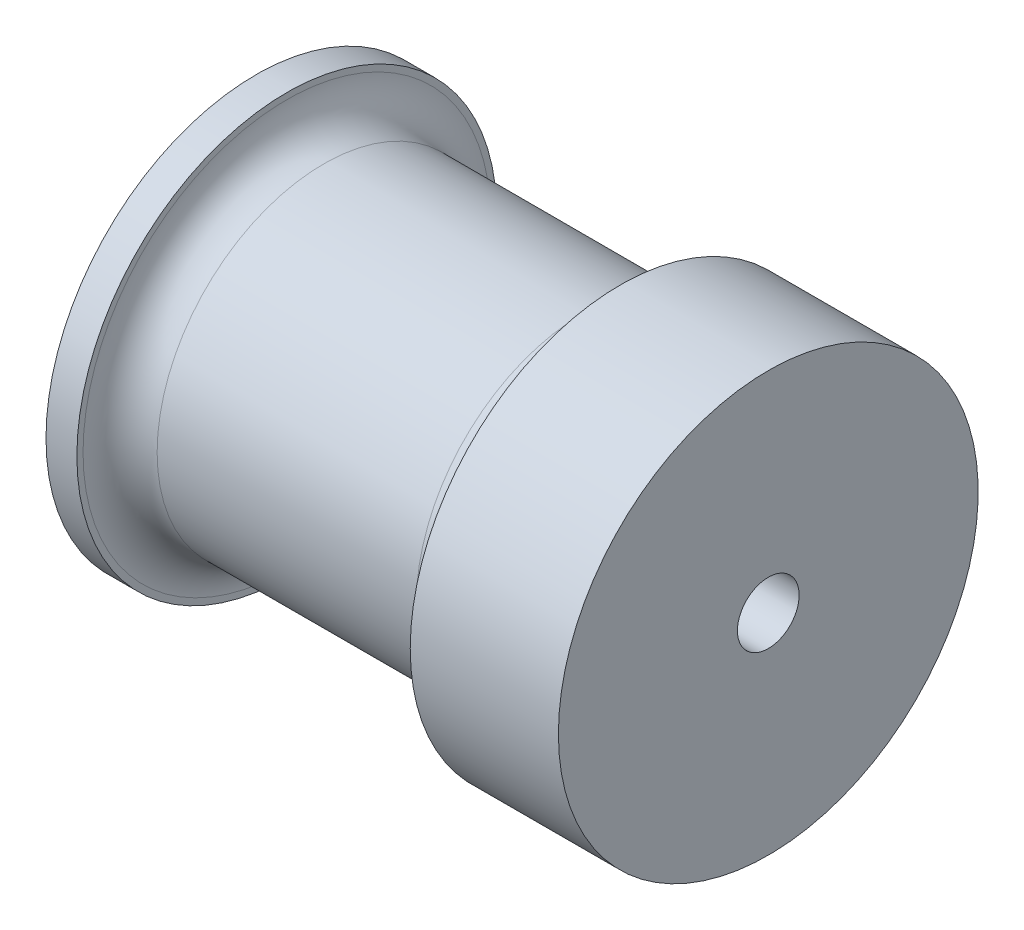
ISO-10303-21;
HEADER;
FILE_DESCRIPTION(('STEP AP214'),'2;1');
FILE_NAME('part.step','',(''),(''),'','','');
FILE_SCHEMA(('AUTOMOTIVE_DESIGN { 1 0 10303 214 1 1 1 1 }'));
ENDSEC;
DATA;
#1=APPLICATION_CONTEXT('core data for automotive mechanical design processes');
#2=APPLICATION_PROTOCOL_DEFINITION('international standard','automotive_design',2000,#1);
#3=PRODUCT_CONTEXT('',#1,'mechanical');
#4=PRODUCT('Part','Part','',(#3));
#5=PRODUCT_RELATED_PRODUCT_CATEGORY('part','',(#4));
#6=PRODUCT_DEFINITION_FORMATION('','',#4);
#7=PRODUCT_DEFINITION_CONTEXT('part definition',#1,'design');
#8=PRODUCT_DEFINITION('design','',#6,#7);
#9=PRODUCT_DEFINITION_SHAPE('','',#8);
#10=(LENGTH_UNIT() NAMED_UNIT(*) SI_UNIT(.MILLI.,.METRE.));
#11=(NAMED_UNIT(*) PLANE_ANGLE_UNIT() SI_UNIT($,.RADIAN.));
#12=(NAMED_UNIT(*) SI_UNIT($,.STERADIAN.) SOLID_ANGLE_UNIT());
#13=UNCERTAINTY_MEASURE_WITH_UNIT(LENGTH_MEASURE(1.E-05),#10,'distance_accuracy_value','');
#14=(GEOMETRIC_REPRESENTATION_CONTEXT(3) GLOBAL_UNCERTAINTY_ASSIGNED_CONTEXT((#13)) GLOBAL_UNIT_ASSIGNED_CONTEXT((#10,
#11,#12)) REPRESENTATION_CONTEXT('',''));
#15=CARTESIAN_POINT('',(0.,0.,0.));
#16=DIRECTION('',(0.,0.,1.));
#17=DIRECTION('',(1.,0.,0.));
#18=AXIS2_PLACEMENT_3D('',#15,#16,#17);
#19=CARTESIAN_POINT('',(-18.073585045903,0.,0.));
#20=DIRECTION('',(-1.,0.,0.));
#21=DIRECTION('',(0.,0.,1.));
#22=AXIS2_PLACEMENT_3D('',#19,#20,#21);
#23=CYLINDRICAL_SURFACE('',#22,9.525);
#24=CARTESIAN_POINT('',(-26.3525,-9.47318262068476,0.992187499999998));
#25=CARTESIAN_POINT('',(-26.2969308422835,-9.47318329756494,0.992185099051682));
#26=CARTESIAN_POINT('',(-26.2413252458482,-9.47367684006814,0.987503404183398));
#27=CARTESIAN_POINT('',(-26.1316566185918,-9.47559733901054,0.968898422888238));
#28=CARTESIAN_POINT('',(-26.0775953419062,-9.47702531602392,0.954965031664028));
#29=CARTESIAN_POINT('',(-25.97261934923,-9.4806512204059,0.918267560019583));
#30=CARTESIAN_POINT('',(-25.9217027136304,-9.48284867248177,0.895508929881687));
#31=CARTESIAN_POINT('',(-25.8244227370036,-9.48776534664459,0.84181767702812));
#32=CARTESIAN_POINT('',(-25.7780585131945,-9.49048446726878,0.810886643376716));
#33=CARTESIAN_POINT('',(-25.691006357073,-9.49615008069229,0.7415979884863));
#34=CARTESIAN_POINT('',(-25.6503388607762,-9.49909733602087,0.703214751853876));
#35=CARTESIAN_POINT('',(-25.5760106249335,-9.50488022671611,0.620166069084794));
#36=CARTESIAN_POINT('',(-25.5423502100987,-9.50771585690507,0.575500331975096));
#37=CARTESIAN_POINT('',(-25.4829205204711,-9.51296358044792,0.481028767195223));
#38=CARTESIAN_POINT('',(-25.4571694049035,-9.51537469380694,0.431211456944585));
#39=CARTESIAN_POINT('',(-25.4144054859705,-9.51949340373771,0.327930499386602));
#40=CARTESIAN_POINT('',(-25.3973924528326,-9.52120101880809,0.27446694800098));
#41=CARTESIAN_POINT('',(-25.3726477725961,-9.52371497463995,0.165618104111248));
#42=CARTESIAN_POINT('',(-25.3648824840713,-9.52452458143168,0.110240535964));
#43=CARTESIAN_POINT('',(-25.3587496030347,-9.5251624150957,-0.0010373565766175));
#44=CARTESIAN_POINT('',(-25.3603817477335,-9.52499066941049,-0.0569376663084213));
#45=CARTESIAN_POINT('',(-25.3729701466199,-9.52368781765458,-0.16744578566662));
#46=CARTESIAN_POINT('',(-25.3838902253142,-9.52256043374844,-0.22205776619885));
#47=CARTESIAN_POINT('',(-25.414688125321,-9.51947725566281,-0.328669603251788));
#48=CARTESIAN_POINT('',(-25.4345660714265,-9.51752144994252,-0.380669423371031));
#49=CARTESIAN_POINT('',(-25.4827549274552,-9.51299488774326,-0.480694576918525));
#50=CARTESIAN_POINT('',(-25.5110817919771,-9.51042296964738,-0.528712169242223));
#51=CARTESIAN_POINT('',(-25.5753528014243,-9.50495264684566,-0.619325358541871));
#52=CARTESIAN_POINT('',(-25.6112971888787,-9.50205423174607,-0.661920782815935));
#53=CARTESIAN_POINT('',(-25.6899862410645,-9.49623979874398,-0.740692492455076));
#54=CARTESIAN_POINT('',(-25.7327623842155,-9.49332376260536,-0.776837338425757));
#55=CARTESIAN_POINT('',(-25.8237917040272,-9.4878164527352,-0.841438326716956));
#56=CARTESIAN_POINT('',(-25.8720448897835,-9.48522517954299,-0.869894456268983));
#57=CARTESIAN_POINT('',(-25.9726833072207,-9.48066060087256,-0.918310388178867));
#58=CARTESIAN_POINT('',(-26.0250695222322,-9.4786874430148,-0.938268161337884));
#59=CARTESIAN_POINT('',(-26.1324746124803,-9.47558552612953,-0.969095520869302));
#60=CARTESIAN_POINT('',(-26.1874934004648,-9.47445673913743,-0.979965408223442));
#61=CARTESIAN_POINT('',(-26.2983255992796,-9.47317625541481,-0.992267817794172));
#62=CARTESIAN_POINT('',(-26.3541340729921,-9.47302000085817,-0.993744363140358));
#63=CARTESIAN_POINT('',(-26.4652038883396,-9.4736902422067,-0.987333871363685));
#64=CARTESIAN_POINT('',(-26.5204652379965,-9.47451672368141,-0.979446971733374));
#65=CARTESIAN_POINT('',(-26.6287432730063,-9.47705516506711,-0.954570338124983));
#66=CARTESIAN_POINT('',(-26.6817648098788,-9.47876509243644,-0.937601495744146));
#67=CARTESIAN_POINT('',(-26.7842090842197,-9.48287611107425,-0.895064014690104));
#68=CARTESIAN_POINT('',(-26.8336317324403,-9.48527721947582,-0.86949516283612));
#69=CARTESIAN_POINT('',(-26.9276757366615,-9.49051107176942,-0.810373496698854));
#70=CARTESIAN_POINT('',(-26.9722786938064,-9.49334537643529,-0.776791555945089));
#71=CARTESIAN_POINT('',(-27.0552304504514,-9.49912119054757,-0.702638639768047));
#72=CARTESIAN_POINT('',(-27.0935790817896,-9.50206270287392,-0.662067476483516));
#73=CARTESIAN_POINT('',(-27.1630858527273,-9.50773529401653,-0.574896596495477));
#74=CARTESIAN_POINT('',(-27.1942152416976,-9.510465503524,-0.528273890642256));
#75=CARTESIAN_POINT('',(-27.2482018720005,-9.51539516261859,-0.430436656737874));
#76=CARTESIAN_POINT('',(-27.271059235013,-9.51759462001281,-0.379222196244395));
#77=CARTESIAN_POINT('',(-27.3078044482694,-9.52121104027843,-0.273754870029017));
#78=CARTESIAN_POINT('',(-27.3217095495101,-9.52262950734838,-0.219508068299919));
#79=CARTESIAN_POINT('',(-27.3402117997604,-9.52453030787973,-0.109434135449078));
#80=CARTESIAN_POINT('',(-27.344809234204,-9.52501267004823,-0.0536070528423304));
#81=CARTESIAN_POINT('',(-27.3445614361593,-9.52498687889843,0.0577605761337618));
#82=CARTESIAN_POINT('',(-27.3397607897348,-9.52448340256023,0.113301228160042));
#83=CARTESIAN_POINT('',(-27.3209467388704,-9.52255174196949,0.222782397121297));
#84=CARTESIAN_POINT('',(-27.3069333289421,-9.52112355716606,0.276722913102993));
#85=CARTESIAN_POINT('',(-27.2701041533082,-9.51750244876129,0.381471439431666));
#86=CARTESIAN_POINT('',(-27.2472898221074,-9.51530964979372,0.432279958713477));
#87=CARTESIAN_POINT('',(-27.1935111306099,-9.5104034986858,0.529353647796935));
#88=CARTESIAN_POINT('',(-27.1625467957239,-9.50769014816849,0.575618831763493));
#89=CARTESIAN_POINT('',(-27.0931801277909,-9.50203130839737,0.662520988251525));
#90=CARTESIAN_POINT('',(-27.0547445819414,-9.49908481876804,0.703131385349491));
#91=CARTESIAN_POINT('',(-26.9715928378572,-9.49330019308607,0.777345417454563));
#92=CARTESIAN_POINT('',(-26.9268751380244,-9.49046208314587,0.810947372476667));
#93=CARTESIAN_POINT('',(-26.8322932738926,-9.48520725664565,0.870264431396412));
#94=CARTESIAN_POINT('',(-26.7824153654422,-9.48279171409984,0.895957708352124));
#95=CARTESIAN_POINT('',(-26.6790592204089,-9.47866945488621,0.938569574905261));
#96=CARTESIAN_POINT('',(-26.6255850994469,-9.47696194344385,0.95549800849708));
#97=CARTESIAN_POINT('',(-26.5352599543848,-9.47487728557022,0.975903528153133));
#98=CARTESIAN_POINT('',(-26.4989853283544,-9.47424481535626,0.982001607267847));
#99=CARTESIAN_POINT('',(-26.425979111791,-9.47339726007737,0.990144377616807));
#100=CARTESIAN_POINT('',(-26.3892475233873,-9.47318217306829,0.992189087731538));
#101=CARTESIAN_POINT('',(-26.3525,-9.47318262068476,0.992187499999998));
#102=B_SPLINE_CURVE_WITH_KNOTS('',3,(#24,#25,#26,#27,#28,#29,#30,#31,#32,#33,#34,#35,#36,#37,
#38,#39,#40,#41,#42,#43,#44,#45,#46,#47,#48,#49,#50,#51,#52,#53,#54,#55,#56,#57,#58,#59,#60,#61,
#62,#63,#64,#65,#66,#67,#68,#69,#70,#71,#72,#73,#74,#75,#76,#77,#78,#79,#80,#81,#82,#83,#84,#85,
#86,#87,#88,#89,#90,#91,#92,#93,#94,#95,#96,#97,#98,#99,#100,#101),.UNSPECIFIED.,.T.,.F.,(4,2,2,
2,2,2,2,2,2,2,2,2,2,2,2,2,2,2,2,2,2,2,2,2,2,2,2,2,2,2,2,2,2,2,2,2,2,2,4),(0.,0.166573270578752,
0.333328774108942,0.499981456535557,0.66660175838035,0.833805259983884,1.00101650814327,
1.16860884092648,1.3361967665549,1.50317316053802,1.67014488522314,1.8364692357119,
2.00279590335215,2.16943866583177,2.33608673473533,2.5035260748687,2.67096569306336,
2.83844526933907,3.00591929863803,3.17260785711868,3.33929396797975,3.505598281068,
3.67190671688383,3.83882912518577,4.00575602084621,4.17333670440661,4.34091492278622,
4.508169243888,4.67541843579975,4.84187609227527,5.00833384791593,5.17476448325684,
5.34119459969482,5.50838222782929,5.67560988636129,5.84329501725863,6.01079140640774,
6.12094574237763,6.23109956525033),.UNSPECIFIED.);
#103=CARTESIAN_POINT('',(-26.3525,-9.47318262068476,0.992187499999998));
#104=VERTEX_POINT('',#103);
#105=EDGE_CURVE('E93',#104,#104,#102,.T.);
#106=ORIENTED_EDGE('',*,*,#105,.T.);
#107=EDGE_LOOP('',(#106));
#108=FACE_BOUND('',#107,.T.);
#109=CARTESIAN_POINT('',(-26.3525,9.47318262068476,0.992187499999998));
#110=CARTESIAN_POINT('',(-26.4080691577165,9.47318329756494,0.992185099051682));
#111=CARTESIAN_POINT('',(-26.4636747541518,9.47367684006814,0.987503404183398));
#112=CARTESIAN_POINT('',(-26.5733433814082,9.47559733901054,0.968898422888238));
#113=CARTESIAN_POINT('',(-26.6274046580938,9.47702531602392,0.954965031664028));
#114=CARTESIAN_POINT('',(-26.73238065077,9.4806512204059,0.918267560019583));
#115=CARTESIAN_POINT('',(-26.7832972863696,9.48284867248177,0.895508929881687));
#116=CARTESIAN_POINT('',(-26.8805772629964,9.48776534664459,0.84181767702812));
#117=CARTESIAN_POINT('',(-26.9269414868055,9.49048446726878,0.810886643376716));
#118=CARTESIAN_POINT('',(-27.013993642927,9.49615008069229,0.7415979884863));
#119=CARTESIAN_POINT('',(-27.0546611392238,9.49909733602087,0.703214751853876));
#120=CARTESIAN_POINT('',(-27.1289893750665,9.50488022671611,0.620166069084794));
#121=CARTESIAN_POINT('',(-27.1626497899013,9.50771585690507,0.575500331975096));
#122=CARTESIAN_POINT('',(-27.2220794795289,9.51296358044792,0.481028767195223));
#123=CARTESIAN_POINT('',(-27.2478305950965,9.51537469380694,0.431211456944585));
#124=CARTESIAN_POINT('',(-27.2905945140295,9.51949340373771,0.327930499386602));
#125=CARTESIAN_POINT('',(-27.3076075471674,9.52120101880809,0.27446694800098));
#126=CARTESIAN_POINT('',(-27.3323522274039,9.52371497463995,0.165618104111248));
#127=CARTESIAN_POINT('',(-27.3401175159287,9.52452458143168,0.110240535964));
#128=CARTESIAN_POINT('',(-27.3462503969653,9.5251624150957,-0.0010373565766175));
#129=CARTESIAN_POINT('',(-27.3446182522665,9.52499066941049,-0.0569376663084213));
#130=CARTESIAN_POINT('',(-27.3320298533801,9.52368781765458,-0.16744578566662));
#131=CARTESIAN_POINT('',(-27.3211097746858,9.52256043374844,-0.22205776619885));
#132=CARTESIAN_POINT('',(-27.290311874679,9.51947725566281,-0.328669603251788));
#133=CARTESIAN_POINT('',(-27.2704339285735,9.51752144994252,-0.380669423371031));
#134=CARTESIAN_POINT('',(-27.2222450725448,9.51299488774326,-0.480694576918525));
#135=CARTESIAN_POINT('',(-27.1939182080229,9.51042296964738,-0.528712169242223));
#136=CARTESIAN_POINT('',(-27.1296471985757,9.50495264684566,-0.619325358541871));
#137=CARTESIAN_POINT('',(-27.0937028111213,9.50205423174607,-0.661920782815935));
#138=CARTESIAN_POINT('',(-27.0150137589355,9.49623979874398,-0.740692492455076));
#139=CARTESIAN_POINT('',(-26.9722376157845,9.49332376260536,-0.776837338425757));
#140=CARTESIAN_POINT('',(-26.8812082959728,9.4878164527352,-0.841438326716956));
#141=CARTESIAN_POINT('',(-26.8329551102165,9.48522517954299,-0.869894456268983));
#142=CARTESIAN_POINT('',(-26.7323166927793,9.48066060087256,-0.918310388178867));
#143=CARTESIAN_POINT('',(-26.6799304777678,9.4786874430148,-0.938268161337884));
#144=CARTESIAN_POINT('',(-26.5725253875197,9.47558552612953,-0.969095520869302));
#145=CARTESIAN_POINT('',(-26.5175065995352,9.47445673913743,-0.979965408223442));
#146=CARTESIAN_POINT('',(-26.4066744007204,9.47317625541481,-0.992267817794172));
#147=CARTESIAN_POINT('',(-26.3508659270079,9.47302000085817,-0.993744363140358));
#148=CARTESIAN_POINT('',(-26.2397961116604,9.4736902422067,-0.987333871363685));
#149=CARTESIAN_POINT('',(-26.1845347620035,9.47451672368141,-0.979446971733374));
#150=CARTESIAN_POINT('',(-26.0762567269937,9.47705516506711,-0.954570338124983));
#151=CARTESIAN_POINT('',(-26.0232351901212,9.47876509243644,-0.937601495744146));
#152=CARTESIAN_POINT('',(-25.9207909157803,9.48287611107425,-0.895064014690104));
#153=CARTESIAN_POINT('',(-25.8713682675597,9.48527721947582,-0.86949516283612));
#154=CARTESIAN_POINT('',(-25.7773242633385,9.49051107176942,-0.810373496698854));
#155=CARTESIAN_POINT('',(-25.7327213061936,9.49334537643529,-0.776791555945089));
#156=CARTESIAN_POINT('',(-25.6497695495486,9.49912119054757,-0.702638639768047));
#157=CARTESIAN_POINT('',(-25.6114209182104,9.50206270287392,-0.662067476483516));
#158=CARTESIAN_POINT('',(-25.5419141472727,9.50773529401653,-0.574896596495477));
#159=CARTESIAN_POINT('',(-25.5107847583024,9.510465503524,-0.528273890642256));
#160=CARTESIAN_POINT('',(-25.4567981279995,9.51539516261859,-0.430436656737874));
#161=CARTESIAN_POINT('',(-25.433940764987,9.51759462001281,-0.379222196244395));
#162=CARTESIAN_POINT('',(-25.3971955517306,9.52121104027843,-0.273754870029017));
#163=CARTESIAN_POINT('',(-25.3832904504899,9.52262950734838,-0.219508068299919));
#164=CARTESIAN_POINT('',(-25.3647882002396,9.52453030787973,-0.109434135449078));
#165=CARTESIAN_POINT('',(-25.360190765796,9.52501267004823,-0.0536070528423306));
#166=CARTESIAN_POINT('',(-25.3604385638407,9.52498687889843,0.0577605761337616));
#167=CARTESIAN_POINT('',(-25.3652392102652,9.52448340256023,0.113301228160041));
#168=CARTESIAN_POINT('',(-25.3840532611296,9.52255174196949,0.222782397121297));
#169=CARTESIAN_POINT('',(-25.3980666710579,9.52112355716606,0.276722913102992));
#170=CARTESIAN_POINT('',(-25.4348958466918,9.51750244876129,0.381471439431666));
#171=CARTESIAN_POINT('',(-25.4577101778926,9.51530964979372,0.432279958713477));
#172=CARTESIAN_POINT('',(-25.5114888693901,9.5104034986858,0.529353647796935));
#173=CARTESIAN_POINT('',(-25.5424532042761,9.50769014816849,0.575618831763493));
#174=CARTESIAN_POINT('',(-25.6118198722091,9.50203130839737,0.662520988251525));
#175=CARTESIAN_POINT('',(-25.6502554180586,9.49908481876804,0.703131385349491));
#176=CARTESIAN_POINT('',(-25.7334071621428,9.49330019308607,0.777345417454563));
#177=CARTESIAN_POINT('',(-25.7781248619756,9.49046208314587,0.810947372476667));
#178=CARTESIAN_POINT('',(-25.8727067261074,9.48520725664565,0.870264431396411));
#179=CARTESIAN_POINT('',(-25.9225846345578,9.48279171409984,0.895957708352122));
#180=CARTESIAN_POINT('',(-26.0259407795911,9.47866945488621,0.93856957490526));
#181=CARTESIAN_POINT('',(-26.0794149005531,9.47696194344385,0.955498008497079));
#182=CARTESIAN_POINT('',(-26.1697400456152,9.47487728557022,0.975903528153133));
#183=CARTESIAN_POINT('',(-26.2060146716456,9.47424481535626,0.982001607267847));
#184=CARTESIAN_POINT('',(-26.279020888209,9.47339726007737,0.990144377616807));
#185=CARTESIAN_POINT('',(-26.3157524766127,9.47318217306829,0.992189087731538));
#186=CARTESIAN_POINT('',(-26.3525,9.47318262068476,0.992187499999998));
#187=B_SPLINE_CURVE_WITH_KNOTS('',3,(#109,#110,#111,#112,#113,#114,#115,#116,#117,#118,#119,
#120,#121,#122,#123,#124,#125,#126,#127,#128,#129,#130,#131,#132,#133,#134,#135,#136,#137,#138,
#139,#140,#141,#142,#143,#144,#145,#146,#147,#148,#149,#150,#151,#152,#153,#154,#155,#156,#157,
#158,#159,#160,#161,#162,#163,#164,#165,#166,#167,#168,#169,#170,#171,#172,#173,#174,#175,#176,
#177,#178,#179,#180,#181,#182,#183,#184,#185,#186),.UNSPECIFIED.,.T.,.F.,(4,2,2,2,2,2,2,2,2,2,2,
2,2,2,2,2,2,2,2,2,2,2,2,2,2,2,2,2,2,2,2,2,2,2,2,2,2,2,4),(0.,0.166573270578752,
0.333328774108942,0.499981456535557,0.66660175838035,0.833805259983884,1.00101650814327,
1.16860884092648,1.3361967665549,1.50317316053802,1.67014488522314,1.8364692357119,
2.00279590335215,2.16943866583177,2.33608673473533,2.5035260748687,2.67096569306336,
2.83844526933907,3.00591929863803,3.17260785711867,3.33929396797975,3.505598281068,
3.67190671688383,3.83882912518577,4.00575602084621,4.17333670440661,4.34091492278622,
4.508169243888,4.67541843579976,4.84187609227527,5.00833384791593,5.17476448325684,
5.34119459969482,5.50838222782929,5.67560988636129,5.84329501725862,6.01079140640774,
6.12094574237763,6.23109956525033),.UNSPECIFIED.);
#188=CARTESIAN_POINT('',(-26.3525,9.47318262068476,0.992187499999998));
#189=VERTEX_POINT('',#188);
#190=EDGE_CURVE('E64',#189,#189,#187,.T.);
#191=ORIENTED_EDGE('',*,*,#190,.T.);
#192=EDGE_LOOP('',(#191));
#193=FACE_BOUND('',#192,.T.);
#194=CARTESIAN_POINT('',(-29.5275,0.,0.));
#195=DIRECTION('',(-1.,0.,0.));
#196=DIRECTION('',(0.,0.,1.));
#197=AXIS2_PLACEMENT_3D('',#194,#195,#196);
#198=CIRCLE('',#197,9.525);
#199=CARTESIAN_POINT('',(-29.5275,0.,9.525));
#200=VERTEX_POINT('',#199);
#201=EDGE_CURVE('E55',#200,#200,#198,.T.);
#202=ORIENTED_EDGE('',*,*,#201,.F.);
#203=EDGE_LOOP('',(#202));
#204=FACE_BOUND('',#203,.T.);
#205=CARTESIAN_POINT('',(-23.1775,0.,0.));
#206=DIRECTION('',(-1.,0.,0.));
#207=DIRECTION('',(0.,0.,1.));
#208=AXIS2_PLACEMENT_3D('',#205,#206,#207);
#209=CIRCLE('',#208,9.525);
#210=CARTESIAN_POINT('',(-23.1775,0.,9.525));
#211=VERTEX_POINT('',#210);
#212=EDGE_CURVE('E160',#211,#211,#209,.T.);
#213=ORIENTED_EDGE('',*,*,#212,.T.);
#214=EDGE_LOOP('',(#213));
#215=FACE_BOUND('',#214,.T.);
#216=ADVANCED_FACE('F35',(#108,#193,#204,#215),#23,.T.);
#217=CARTESIAN_POINT('',(-29.5275,3.175,0.));
#218=DIRECTION('',(1.,0.,0.));
#219=DIRECTION('',(0.,0.,-1.));
#220=AXIS2_PLACEMENT_3D('',#217,#218,#219);
#221=PLANE('',#220);
#222=CARTESIAN_POINT('',(-29.5275,0.,0.));
#223=DIRECTION('',(-1.,0.,0.));
#224=DIRECTION('',(0.,0.,1.));
#225=AXIS2_PLACEMENT_3D('',#222,#223,#224);
#226=CIRCLE('',#225,3.175);
#227=CARTESIAN_POINT('',(-29.5275,0.,3.175));
#228=VERTEX_POINT('',#227);
#229=EDGE_CURVE('E146',#228,#228,#226,.T.);
#230=ORIENTED_EDGE('',*,*,#229,.F.);
#231=EDGE_LOOP('',(#230));
#232=FACE_BOUND('',#231,.T.);
#233=ORIENTED_EDGE('',*,*,#201,.T.);
#234=EDGE_LOOP('',(#233));
#235=FACE_BOUND('',#234,.T.);
#236=ADVANCED_FACE('F100',(#232,#235),#221,.F.);
#237=CARTESIAN_POINT('',(-18.073585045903,0.,0.));
#238=DIRECTION('',(-1.,0.,0.));
#239=DIRECTION('',(0.,0.,1.));
#240=AXIS2_PLACEMENT_3D('',#237,#238,#239);
#241=CYLINDRICAL_SURFACE('',#240,3.175);
#242=CARTESIAN_POINT('',(-26.3525,-3.01598888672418,0.992187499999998));
#243=CARTESIAN_POINT('',(-26.4067504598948,-3.01598922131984,0.992187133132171));
#244=CARTESIAN_POINT('',(-26.4610046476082,-3.01746865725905,0.987722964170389));
#245=CARTESIAN_POINT('',(-26.5679191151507,-3.02320038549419,0.9700353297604));
#246=CARTESIAN_POINT('',(-26.620578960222,-3.02745342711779,0.956809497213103));
#247=CARTESIAN_POINT('',(-26.7227406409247,-3.03820463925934,0.922097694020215));
#248=CARTESIAN_POINT('',(-26.772247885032,-3.04469883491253,0.900626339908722));
#249=CARTESIAN_POINT('',(-26.8669712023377,-3.0591950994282,0.850081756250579));
#250=CARTESIAN_POINT('',(-26.9121865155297,-3.06719743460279,0.821007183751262));
#251=CARTESIAN_POINT('',(-26.9985957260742,-3.08411663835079,0.75501188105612));
#252=CARTESIAN_POINT('',(-27.0396204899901,-3.09305422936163,0.717874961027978));
#253=CARTESIAN_POINT('',(-27.1149730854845,-3.11066057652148,0.637271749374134));
#254=CARTESIAN_POINT('',(-27.1492999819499,-3.11932929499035,0.593804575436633));
#255=CARTESIAN_POINT('',(-27.2110287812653,-3.13565820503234,0.500559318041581));
#256=CARTESIAN_POINT('',(-27.2382565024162,-3.14329115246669,0.450660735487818));
#257=CARTESIAN_POINT('',(-27.2838672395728,-3.15644650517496,0.346713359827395));
#258=CARTESIAN_POINT('',(-27.3022523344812,-3.16196940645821,0.2926655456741));
#259=CARTESIAN_POINT('',(-27.3290912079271,-3.170135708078,0.18372483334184));
#260=CARTESIAN_POINT('',(-27.3378340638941,-3.17286274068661,0.128909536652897));
#261=CARTESIAN_POINT('',(-27.3460561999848,-3.17542541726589,0.0185267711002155));
#262=CARTESIAN_POINT('',(-27.3455375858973,-3.17526171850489,-0.0370405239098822));
#263=CARTESIAN_POINT('',(-27.3354416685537,-3.17211960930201,-0.145315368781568));
#264=CARTESIAN_POINT('',(-27.3261777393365,-3.16923857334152,-0.19805541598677));
#265=CARTESIAN_POINT('',(-27.2993683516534,-3.16110526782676,-0.30119086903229));
#266=CARTESIAN_POINT('',(-27.2818223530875,-3.15585284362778,-0.351586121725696));
#267=CARTESIAN_POINT('',(-27.2387455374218,-3.14343621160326,-0.449324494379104));
#268=CARTESIAN_POINT('',(-27.2131196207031,-3.13624939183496,-0.496622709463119));
#269=CARTESIAN_POINT('',(-27.1546866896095,-3.12072117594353,-0.586345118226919));
#270=CARTESIAN_POINT('',(-27.1218778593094,-3.11237948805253,-0.62876807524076));
#271=CARTESIAN_POINT('',(-27.0484015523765,-3.09501913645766,-0.709404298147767));
#272=CARTESIAN_POINT('',(-27.0074635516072,-3.08598674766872,-0.747368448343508));
#273=CARTESIAN_POINT('',(-26.9197176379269,-3.06856301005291,-0.815966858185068));
#274=CARTESIAN_POINT('',(-26.8729090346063,-3.06017173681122,-0.84660025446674));
#275=CARTESIAN_POINT('',(-26.7740467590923,-3.04491109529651,-0.899957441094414));
#276=CARTESIAN_POINT('',(-26.7219402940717,-3.03805979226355,-0.922588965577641));
#277=CARTESIAN_POINT('',(-26.6143902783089,-3.02686676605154,-0.958678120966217));
#278=CARTESIAN_POINT('',(-26.5589479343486,-3.02252414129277,-0.97213904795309));
#279=CARTESIAN_POINT('',(-26.4486866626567,-3.01704028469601,-0.989024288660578));
#280=CARTESIAN_POINT('',(-26.3939321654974,-3.01577745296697,-0.992830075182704));
#281=CARTESIAN_POINT('',(-26.2845631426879,-3.016258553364,-0.991367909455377));
#282=CARTESIAN_POINT('',(-26.2299485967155,-3.01800202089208,-0.986101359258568));
#283=CARTESIAN_POINT('',(-26.1240521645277,-3.02417922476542,-0.966984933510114));
#284=CARTESIAN_POINT('',(-26.0727195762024,-3.02853371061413,-0.953387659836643));
#285=CARTESIAN_POINT('',(-25.9730702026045,-3.03935834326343,-0.918292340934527));
#286=CARTESIAN_POINT('',(-25.9247539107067,-3.04582883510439,-0.896793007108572));
#287=CARTESIAN_POINT('',(-25.8309752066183,-3.06038678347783,-0.845800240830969));
#288=CARTESIAN_POINT('',(-25.7856343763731,-3.06851529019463,-0.816095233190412));
#289=CARTESIAN_POINT('',(-25.7004420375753,-3.08538839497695,-0.749781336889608));
#290=CARTESIAN_POINT('',(-25.6605919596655,-3.09413315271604,-0.713170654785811));
#291=CARTESIAN_POINT('',(-25.5858086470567,-3.11169198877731,-0.632279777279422));
#292=CARTESIAN_POINT('',(-25.5511476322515,-3.12049392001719,-0.58774460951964));
#293=CARTESIAN_POINT('',(-25.4897802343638,-3.13681316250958,-0.493277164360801));
#294=CARTESIAN_POINT('',(-25.4630734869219,-3.14433053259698,-0.443345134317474));
#295=CARTESIAN_POINT('',(-25.4186288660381,-3.15719072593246,-0.339808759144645));
#296=CARTESIAN_POINT('',(-25.4008260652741,-3.162549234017,-0.286234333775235));
#297=CARTESIAN_POINT('',(-25.3745424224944,-3.1705569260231,-0.176654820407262));
#298=CARTESIAN_POINT('',(-25.3660586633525,-3.17320695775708,-0.120650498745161));
#299=CARTESIAN_POINT('',(-25.3588908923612,-3.1754429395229,-0.010306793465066));
#300=CARTESIAN_POINT('',(-25.359813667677,-3.17515183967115,0.0440048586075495));
#301=CARTESIAN_POINT('',(-25.3704818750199,-3.17183276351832,0.151664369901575));
#302=CARTESIAN_POINT('',(-25.3802267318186,-3.1688049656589,0.205012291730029));
#303=CARTESIAN_POINT('',(-25.4080121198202,-3.16039159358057,0.308574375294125));
#304=CARTESIAN_POINT('',(-25.4259473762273,-3.15503598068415,0.358819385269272));
#305=CARTESIAN_POINT('',(-25.4695093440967,-3.14251931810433,0.455611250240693));
#306=CARTESIAN_POINT('',(-25.4951373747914,-3.13535795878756,0.502157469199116));
#307=CARTESIAN_POINT('',(-25.5543627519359,-3.11967480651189,0.591948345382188));
#308=CARTESIAN_POINT('',(-25.5882009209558,-3.11111510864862,0.635027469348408));
#309=CARTESIAN_POINT('',(-25.6624612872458,-3.09370997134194,0.715026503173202));
#310=CARTESIAN_POINT('',(-25.7028854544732,-3.08486444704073,0.751944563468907));
#311=CARTESIAN_POINT('',(-25.7907756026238,-3.06754127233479,0.819807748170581));
#312=CARTESIAN_POINT('',(-25.8384305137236,-3.0590855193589,0.85051445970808));
#313=CARTESIAN_POINT('',(-25.9384785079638,-3.04387349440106,0.903449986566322));
#314=CARTESIAN_POINT('',(-25.9908696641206,-3.03711653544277,0.9256822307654));
#315=CARTESIAN_POINT('',(-26.0943110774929,-3.02662082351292,0.959414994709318));
#316=CARTESIAN_POINT('',(-26.1450951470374,-3.02267393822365,0.971668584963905));
#317=CARTESIAN_POINT('',(-26.2480852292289,-3.01735812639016,0.9880540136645));
#318=CARTESIAN_POINT('',(-26.3002908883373,-3.01598856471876,0.992187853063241));
#319=CARTESIAN_POINT('',(-26.3525,-3.01598888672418,0.992187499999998));
#320=B_SPLINE_CURVE_WITH_KNOTS('',3,(#242,#243,#244,#245,#246,#247,#248,#249,#250,#251,#252,
#253,#254,#255,#256,#257,#258,#259,#260,#261,#262,#263,#264,#265,#266,#267,#268,#269,#270,#271,
#272,#273,#274,#275,#276,#277,#278,#279,#280,#281,#282,#283,#284,#285,#286,#287,#288,#289,#290,
#291,#292,#293,#294,#295,#296,#297,#298,#299,#300,#301,#302,#303,#304,#305,#306,#307,#308,#309,
#310,#311,#312,#313,#314,#315,#316,#317,#318,#319),.UNSPECIFIED.,.T.,.F.,(4,2,2,2,2,2,2,2,2,2,2,
2,2,2,2,2,2,2,2,2,2,2,2,2,2,2,2,2,2,2,2,2,2,2,2,2,2,2,4),(0.,0.162558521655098,
0.325160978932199,0.487476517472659,0.649820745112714,0.817221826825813,0.984646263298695,
1.15585733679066,1.32702813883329,1.49291454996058,1.65876324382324,1.81888592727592,
1.97901905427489,2.14111208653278,2.30324614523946,2.47213706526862,2.64104786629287,
2.81184723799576,2.9825851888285,3.14646415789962,3.3103178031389,3.46943340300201,
3.62857496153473,3.79228043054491,3.95602847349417,4.12656288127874,4.29708947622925,
4.46635377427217,4.63556507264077,4.7977329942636,4.95989034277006,5.12001965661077,
5.28017644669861,5.44576550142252,5.61140417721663,5.78253062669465,5.95358776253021,
6.11006806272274,6.2665097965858),.UNSPECIFIED.);
#321=CARTESIAN_POINT('',(-26.3525,-3.01598888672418,0.992187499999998));
#322=VERTEX_POINT('',#321);
#323=EDGE_CURVE('E56',#322,#322,#320,.T.);
#324=ORIENTED_EDGE('',*,*,#323,.T.);
#325=EDGE_LOOP('',(#324));
#326=FACE_BOUND('',#325,.T.);
#327=CARTESIAN_POINT('',(-26.3525,3.01598888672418,0.992187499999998));
#328=CARTESIAN_POINT('',(-26.2982495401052,3.01598922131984,0.992187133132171));
#329=CARTESIAN_POINT('',(-26.2439953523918,3.01746865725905,0.98772296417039));
#330=CARTESIAN_POINT('',(-26.1370808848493,3.02320038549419,0.970035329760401));
#331=CARTESIAN_POINT('',(-26.084421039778,3.02745342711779,0.956809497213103));
#332=CARTESIAN_POINT('',(-25.9822593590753,3.03820463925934,0.922097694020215));
#333=CARTESIAN_POINT('',(-25.932752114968,3.04469883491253,0.900626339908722));
#334=CARTESIAN_POINT('',(-25.8380287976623,3.0591950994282,0.850081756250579));
#335=CARTESIAN_POINT('',(-25.7928134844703,3.06719743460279,0.821007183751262));
#336=CARTESIAN_POINT('',(-25.7064042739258,3.08411663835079,0.75501188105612));
#337=CARTESIAN_POINT('',(-25.6653795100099,3.09305422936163,0.717874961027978));
#338=CARTESIAN_POINT('',(-25.5900269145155,3.11066057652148,0.637271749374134));
#339=CARTESIAN_POINT('',(-25.5557000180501,3.11932929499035,0.593804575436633));
#340=CARTESIAN_POINT('',(-25.4939712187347,3.13565820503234,0.500559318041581));
#341=CARTESIAN_POINT('',(-25.4667434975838,3.14329115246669,0.450660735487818));
#342=CARTESIAN_POINT('',(-25.4211327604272,3.15644650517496,0.346713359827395));
#343=CARTESIAN_POINT('',(-25.4027476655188,3.16196940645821,0.2926655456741));
#344=CARTESIAN_POINT('',(-25.3759087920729,3.170135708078,0.18372483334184));
#345=CARTESIAN_POINT('',(-25.3671659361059,3.17286274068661,0.128909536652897));
#346=CARTESIAN_POINT('',(-25.3589438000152,3.17542541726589,0.0185267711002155));
#347=CARTESIAN_POINT('',(-25.3594624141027,3.17526171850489,-0.0370405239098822));
#348=CARTESIAN_POINT('',(-25.3695583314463,3.17211960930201,-0.145315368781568));
#349=CARTESIAN_POINT('',(-25.3788222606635,3.16923857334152,-0.19805541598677));
#350=CARTESIAN_POINT('',(-25.4056316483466,3.16110526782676,-0.30119086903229));
#351=CARTESIAN_POINT('',(-25.4231776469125,3.15585284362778,-0.351586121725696));
#352=CARTESIAN_POINT('',(-25.4662544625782,3.14343621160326,-0.449324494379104));
#353=CARTESIAN_POINT('',(-25.4918803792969,3.13624939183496,-0.496622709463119));
#354=CARTESIAN_POINT('',(-25.5503133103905,3.12072117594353,-0.586345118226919));
#355=CARTESIAN_POINT('',(-25.5831221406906,3.11237948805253,-0.62876807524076));
#356=CARTESIAN_POINT('',(-25.6565984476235,3.09501913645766,-0.709404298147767));
#357=CARTESIAN_POINT('',(-25.6975364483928,3.08598674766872,-0.747368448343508));
#358=CARTESIAN_POINT('',(-25.7852823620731,3.06856301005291,-0.815966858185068));
#359=CARTESIAN_POINT('',(-25.8320909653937,3.06017173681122,-0.84660025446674));
#360=CARTESIAN_POINT('',(-25.9309532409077,3.04491109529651,-0.899957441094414));
#361=CARTESIAN_POINT('',(-25.9830597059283,3.03805979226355,-0.922588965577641));
#362=CARTESIAN_POINT('',(-26.0906097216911,3.02686676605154,-0.958678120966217));
#363=CARTESIAN_POINT('',(-26.1460520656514,3.02252414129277,-0.97213904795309));
#364=CARTESIAN_POINT('',(-26.2563133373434,3.01704028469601,-0.989024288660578));
#365=CARTESIAN_POINT('',(-26.3110678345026,3.01577745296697,-0.992830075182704));
#366=CARTESIAN_POINT('',(-26.4204368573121,3.016258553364,-0.991367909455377));
#367=CARTESIAN_POINT('',(-26.4750514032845,3.01800202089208,-0.986101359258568));
#368=CARTESIAN_POINT('',(-26.5809478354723,3.02417922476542,-0.966984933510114));
#369=CARTESIAN_POINT('',(-26.6322804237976,3.02853371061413,-0.953387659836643));
#370=CARTESIAN_POINT('',(-26.7319297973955,3.03935834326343,-0.918292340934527));
#371=CARTESIAN_POINT('',(-26.7802460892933,3.04582883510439,-0.896793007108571));
#372=CARTESIAN_POINT('',(-26.8740247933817,3.06038678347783,-0.845800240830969));
#373=CARTESIAN_POINT('',(-26.9193656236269,3.06851529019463,-0.816095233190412));
#374=CARTESIAN_POINT('',(-27.0045579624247,3.08538839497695,-0.749781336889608));
#375=CARTESIAN_POINT('',(-27.0444080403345,3.09413315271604,-0.713170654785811));
#376=CARTESIAN_POINT('',(-27.1191913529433,3.11169198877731,-0.632279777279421));
#377=CARTESIAN_POINT('',(-27.1538523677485,3.12049392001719,-0.587744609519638));
#378=CARTESIAN_POINT('',(-27.2152197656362,3.13681316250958,-0.493277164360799));
#379=CARTESIAN_POINT('',(-27.2419265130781,3.14433053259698,-0.443345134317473));
#380=CARTESIAN_POINT('',(-27.2863711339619,3.15719072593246,-0.339808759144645));
#381=CARTESIAN_POINT('',(-27.3041739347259,3.162549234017,-0.286234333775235));
#382=CARTESIAN_POINT('',(-27.3304575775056,3.1705569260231,-0.176654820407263));
#383=CARTESIAN_POINT('',(-27.3389413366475,3.17320695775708,-0.120650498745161));
#384=CARTESIAN_POINT('',(-27.3461091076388,3.1754429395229,-0.010306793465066));
#385=CARTESIAN_POINT('',(-27.345186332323,3.17515183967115,0.0440048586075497));
#386=CARTESIAN_POINT('',(-27.3345181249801,3.17183276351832,0.151664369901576));
#387=CARTESIAN_POINT('',(-27.3247732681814,3.1688049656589,0.20501229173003));
#388=CARTESIAN_POINT('',(-27.2969878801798,3.16039159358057,0.308574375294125));
#389=CARTESIAN_POINT('',(-27.2790526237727,3.15503598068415,0.358819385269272));
#390=CARTESIAN_POINT('',(-27.2354906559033,3.14251931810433,0.455611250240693));
#391=CARTESIAN_POINT('',(-27.2098626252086,3.13535795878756,0.502157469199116));
#392=CARTESIAN_POINT('',(-27.1506372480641,3.11967480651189,0.591948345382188));
#393=CARTESIAN_POINT('',(-27.1167990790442,3.11111510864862,0.635027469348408));
#394=CARTESIAN_POINT('',(-27.0425387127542,3.09370997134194,0.715026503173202));
#395=CARTESIAN_POINT('',(-27.0021145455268,3.08486444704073,0.751944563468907));
#396=CARTESIAN_POINT('',(-26.9142243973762,3.06754127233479,0.819807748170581));
#397=CARTESIAN_POINT('',(-26.8665694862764,3.0590855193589,0.85051445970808));
#398=CARTESIAN_POINT('',(-26.7665214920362,3.04387349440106,0.903449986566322));
#399=CARTESIAN_POINT('',(-26.7141303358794,3.03711653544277,0.9256822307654));
#400=CARTESIAN_POINT('',(-26.6106889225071,3.02662082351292,0.959414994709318));
#401=CARTESIAN_POINT('',(-26.5599048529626,3.02267393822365,0.971668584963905));
#402=CARTESIAN_POINT('',(-26.4569147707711,3.01735812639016,0.9880540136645));
#403=CARTESIAN_POINT('',(-26.4047091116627,3.01598856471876,0.992187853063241));
#404=CARTESIAN_POINT('',(-26.3525,3.01598888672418,0.992187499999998));
#405=B_SPLINE_CURVE_WITH_KNOTS('',3,(#327,#328,#329,#330,#331,#332,#333,#334,#335,#336,#337,
#338,#339,#340,#341,#342,#343,#344,#345,#346,#347,#348,#349,#350,#351,#352,#353,#354,#355,#356,
#357,#358,#359,#360,#361,#362,#363,#364,#365,#366,#367,#368,#369,#370,#371,#372,#373,#374,#375,
#376,#377,#378,#379,#380,#381,#382,#383,#384,#385,#386,#387,#388,#389,#390,#391,#392,#393,#394,
#395,#396,#397,#398,#399,#400,#401,#402,#403,#404),.UNSPECIFIED.,.T.,.F.,(4,2,2,2,2,2,2,2,2,2,2,
2,2,2,2,2,2,2,2,2,2,2,2,2,2,2,2,2,2,2,2,2,2,2,2,2,2,2,4),(0.,0.162558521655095,
0.325160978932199,0.487476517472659,0.649820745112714,0.817221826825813,0.984646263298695,
1.15585733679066,1.32702813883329,1.49291454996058,1.65876324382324,1.81888592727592,
1.97901905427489,2.14111208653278,2.30324614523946,2.47213706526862,2.64104786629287,
2.81184723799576,2.9825851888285,3.14646415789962,3.3103178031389,3.46943340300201,
3.62857496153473,3.79228043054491,3.95602847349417,4.12656288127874,4.29708947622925,
4.46635377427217,4.63556507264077,4.7977329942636,4.95989034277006,5.12001965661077,
5.28017644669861,5.44576550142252,5.61140417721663,5.78253062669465,5.95358776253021,
6.11006806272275,6.26650979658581),.UNSPECIFIED.);
#406=CARTESIAN_POINT('',(-26.3525,3.01598888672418,0.992187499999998));
#407=VERTEX_POINT('',#406);
#408=EDGE_CURVE('E65',#407,#407,#405,.T.);
#409=ORIENTED_EDGE('',*,*,#408,.T.);
#410=EDGE_LOOP('',(#409));
#411=FACE_BOUND('',#410,.T.);
#412=CARTESIAN_POINT('',(29.5275,0.,0.));
#413=DIRECTION('',(-1.,0.,0.));
#414=DIRECTION('',(0.,0.,1.));
#415=AXIS2_PLACEMENT_3D('',#412,#413,#414);
#416=CIRCLE('',#415,3.175);
#417=CARTESIAN_POINT('',(29.5275,0.,3.175));
#418=VERTEX_POINT('',#417);
#419=EDGE_CURVE('E144',#418,#418,#416,.T.);
#420=ORIENTED_EDGE('',*,*,#419,.F.);
#421=EDGE_LOOP('',(#420));
#422=FACE_BOUND('',#421,.T.);
#423=ORIENTED_EDGE('',*,*,#229,.T.);
#424=EDGE_LOOP('',(#423));
#425=FACE_BOUND('',#424,.T.);
#426=ADVANCED_FACE('F70',(#326,#411,#422,#425),#241,.F.);
#427=CARTESIAN_POINT('',(29.5275,21.59,0.));
#428=DIRECTION('',(-1.,0.,0.));
#429=DIRECTION('',(0.,0.,1.));
#430=AXIS2_PLACEMENT_3D('',#427,#428,#429);
#431=PLANE('',#430);
#432=CARTESIAN_POINT('',(29.5275,0.,0.));
#433=DIRECTION('',(-1.,0.,0.));
#434=DIRECTION('',(0.,0.,1.));
#435=AXIS2_PLACEMENT_3D('',#432,#433,#434);
#436=CIRCLE('',#435,21.59);
#437=CARTESIAN_POINT('',(29.5275,0.,21.59));
#438=VERTEX_POINT('',#437);
#439=EDGE_CURVE('E141',#438,#438,#436,.T.);
#440=ORIENTED_EDGE('',*,*,#439,.F.);
#441=EDGE_LOOP('',(#440));
#442=FACE_BOUND('',#441,.T.);
#443=ORIENTED_EDGE('',*,*,#419,.T.);
#444=EDGE_LOOP('',(#443));
#445=FACE_BOUND('',#444,.T.);
#446=ADVANCED_FACE('F130',(#442,#445),#431,.F.);
#447=CARTESIAN_POINT('',(-18.073585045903,0.,0.));
#448=DIRECTION('',(-1.,0.,0.));
#449=DIRECTION('',(0.,0.,1.));
#450=AXIS2_PLACEMENT_3D('',#447,#448,#449);
#451=CYLINDRICAL_SURFACE('',#450,21.59);
#452=CARTESIAN_POINT('',(14.2875,0.,0.));
#453=DIRECTION('',(-1.,0.,0.));
#454=DIRECTION('',(0.,0.,1.));
#455=AXIS2_PLACEMENT_3D('',#452,#453,#454);
#456=CIRCLE('',#455,21.59);
#457=CARTESIAN_POINT('',(14.2875,0.,21.59));
#458=VERTEX_POINT('',#457);
#459=EDGE_CURVE('E150',#458,#458,#456,.T.);
#460=ORIENTED_EDGE('',*,*,#459,.F.);
#461=EDGE_LOOP('',(#460));
#462=FACE_BOUND('',#461,.T.);
#463=ORIENTED_EDGE('',*,*,#439,.T.);
#464=EDGE_LOOP('',(#463));
#465=FACE_BOUND('',#464,.T.);
#466=ADVANCED_FACE('F126',(#462,#465),#451,.T.);
#467=CARTESIAN_POINT('',(14.2875,17.145,0.));
#468=DIRECTION('',(1.,0.,0.));
#469=DIRECTION('',(0.,0.,-1.));
#470=AXIS2_PLACEMENT_3D('',#467,#468,#469);
#471=PLANE('',#470);
#472=CARTESIAN_POINT('',(14.2875,0.,0.));
#473=DIRECTION('',(1.,0.,0.));
#474=DIRECTION('',(0.,0.,-1.));
#475=AXIS2_PLACEMENT_3D('',#472,#473,#474);
#476=CIRCLE('',#475,20.955);
#477=CARTESIAN_POINT('',(14.2875,0.,-20.955));
#478=VERTEX_POINT('',#477);
#479=EDGE_CURVE('E42',#478,#478,#476,.T.);
#480=ORIENTED_EDGE('',*,*,#479,.T.);
#481=EDGE_LOOP('',(#480));
#482=FACE_BOUND('',#481,.T.);
#483=ORIENTED_EDGE('',*,*,#459,.T.);
#484=EDGE_LOOP('',(#483));
#485=FACE_BOUND('',#484,.T.);
#486=ADVANCED_FACE('F116',(#482,#485),#471,.F.);
#487=CARTESIAN_POINT('',(-18.073585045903,0.,0.));
#488=DIRECTION('',(-1.,0.,0.));
#489=DIRECTION('',(0.,0.,1.));
#490=AXIS2_PLACEMENT_3D('',#487,#488,#489);
#491=CYLINDRICAL_SURFACE('',#490,17.145);
#492=CARTESIAN_POINT('',(10.4775,0.,0.));
#493=DIRECTION('',(1.,0.,0.));
#494=DIRECTION('',(0.,0.,-1.));
#495=AXIS2_PLACEMENT_3D('',#492,#493,#494);
#496=CIRCLE('',#495,17.145);
#497=CARTESIAN_POINT('',(10.4775,0.,-17.145));
#498=VERTEX_POINT('',#497);
#499=EDGE_CURVE('E46',#498,#498,#496,.F.);
#500=ORIENTED_EDGE('',*,*,#499,.T.);
#501=EDGE_LOOP('',(#500));
#502=FACE_BOUND('',#501,.T.);
#503=CARTESIAN_POINT('',(-16.1925,0.,0.));
#504=DIRECTION('',(-1.,0.,0.));
#505=DIRECTION('',(0.,0.,1.));
#506=AXIS2_PLACEMENT_3D('',#503,#504,#505);
#507=CIRCLE('',#506,17.145);
#508=CARTESIAN_POINT('',(-16.1925,0.,17.145));
#509=VERTEX_POINT('',#508);
#510=EDGE_CURVE('E50',#509,#509,#507,.F.);
#511=ORIENTED_EDGE('',*,*,#510,.T.);
#512=EDGE_LOOP('',(#511));
#513=FACE_BOUND('',#512,.T.);
#514=ADVANCED_FACE('F112',(#502,#513),#491,.T.);
#515=CARTESIAN_POINT('',(-20.0025,21.59,0.));
#516=DIRECTION('',(-1.,0.,0.));
#517=DIRECTION('',(0.,0.,1.));
#518=AXIS2_PLACEMENT_3D('',#515,#516,#517);
#519=PLANE('',#518);
#520=CARTESIAN_POINT('',(-20.0025,0.,0.));
#521=DIRECTION('',(-1.,0.,0.));
#522=DIRECTION('',(0.,0.,1.));
#523=AXIS2_PLACEMENT_3D('',#520,#521,#522);
#524=CIRCLE('',#523,20.955);
#525=CARTESIAN_POINT('',(-20.0025,0.,20.955));
#526=VERTEX_POINT('',#525);
#527=EDGE_CURVE('E10',#526,#526,#524,.T.);
#528=ORIENTED_EDGE('',*,*,#527,.T.);
#529=EDGE_LOOP('',(#528));
#530=FACE_BOUND('',#529,.T.);
#531=CARTESIAN_POINT('',(-20.0025,0.,0.));
#532=DIRECTION('',(-1.,0.,0.));
#533=DIRECTION('',(0.,0.,1.));
#534=AXIS2_PLACEMENT_3D('',#531,#532,#533);
#535=CIRCLE('',#534,21.59);
#536=CARTESIAN_POINT('',(-20.0025,0.,21.59));
#537=VERTEX_POINT('',#536);
#538=EDGE_CURVE('E164',#537,#537,#535,.T.);
#539=ORIENTED_EDGE('',*,*,#538,.F.);
#540=EDGE_LOOP('',(#539));
#541=FACE_BOUND('',#540,.T.);
#542=ADVANCED_FACE('F115',(#530,#541),#519,.F.);
#543=CARTESIAN_POINT('',(-18.073585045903,0.,0.));
#544=DIRECTION('',(-1.,0.,0.));
#545=DIRECTION('',(0.,0.,1.));
#546=AXIS2_PLACEMENT_3D('',#543,#544,#545);
#547=CYLINDRICAL_SURFACE('',#546,21.59);
#548=CARTESIAN_POINT('',(-23.1775,0.,0.));
#549=DIRECTION('',(-1.,0.,0.));
#550=DIRECTION('',(0.,0.,1.));
#551=AXIS2_PLACEMENT_3D('',#548,#549,#550);
#552=CIRCLE('',#551,21.59);
#553=CARTESIAN_POINT('',(-23.1775,0.,21.59));
#554=VERTEX_POINT('',#553);
#555=EDGE_CURVE('E162',#554,#554,#552,.T.);
#556=ORIENTED_EDGE('',*,*,#555,.F.);
#557=EDGE_LOOP('',(#556));
#558=FACE_BOUND('',#557,.T.);
#559=ORIENTED_EDGE('',*,*,#538,.T.);
#560=EDGE_LOOP('',(#559));
#561=FACE_BOUND('',#560,.T.);
#562=ADVANCED_FACE('F124',(#558,#561),#547,.T.);
#563=CARTESIAN_POINT('',(-23.1775,9.525,0.));
#564=DIRECTION('',(1.,0.,0.));
#565=DIRECTION('',(0.,0.,-1.));
#566=AXIS2_PLACEMENT_3D('',#563,#564,#565);
#567=PLANE('',#566);
#568=ORIENTED_EDGE('',*,*,#212,.F.);
#569=EDGE_LOOP('',(#568));
#570=FACE_BOUND('',#569,.T.);
#571=ORIENTED_EDGE('',*,*,#555,.T.);
#572=EDGE_LOOP('',(#571));
#573=FACE_BOUND('',#572,.T.);
#574=ADVANCED_FACE('F81',(#570,#573),#567,.F.);
#575=CARTESIAN_POINT('',(-26.3525,-21.59,0.));
#576=DIRECTION('',(0.,1.,0.));
#577=DIRECTION('',(0.,0.,1.));
#578=AXIS2_PLACEMENT_3D('',#575,#576,#577);
#579=CYLINDRICAL_SURFACE('',#578,0.992187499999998);
#580=ORIENTED_EDGE('',*,*,#408,.F.);
#581=EDGE_LOOP('',(#580));
#582=FACE_BOUND('',#581,.T.);
#583=ORIENTED_EDGE('',*,*,#190,.F.);
#584=EDGE_LOOP('',(#583));
#585=FACE_BOUND('',#584,.T.);
#586=ADVANCED_FACE('F79',(#582,#585),#579,.F.);
#587=ORIENTED_EDGE('',*,*,#323,.F.);
#588=EDGE_LOOP('',(#587));
#589=FACE_BOUND('',#588,.T.);
#590=ORIENTED_EDGE('',*,*,#105,.F.);
#591=EDGE_LOOP('',(#590));
#592=FACE_BOUND('',#591,.T.);
#593=ADVANCED_FACE('F74',(#589,#592),#579,.F.);
#594=CARTESIAN_POINT('',(10.4775,0.,0.));
#595=DIRECTION('',(1.,0.,0.));
#596=DIRECTION('',(0.,0.,-1.));
#597=AXIS2_PLACEMENT_3D('',#594,#595,#596);
#598=TOROIDAL_SURFACE('',#597,20.955,3.81);
#599=ORIENTED_EDGE('',*,*,#479,.F.);
#600=EDGE_LOOP('',(#599));
#601=FACE_BOUND('',#600,.T.);
#602=ORIENTED_EDGE('',*,*,#499,.F.);
#603=EDGE_LOOP('',(#602));
#604=FACE_BOUND('',#603,.T.);
#605=ADVANCED_FACE('F78',(#601,#604),#598,.F.);
#606=CARTESIAN_POINT('',(-16.1925,0.,0.));
#607=DIRECTION('',(-1.,0.,0.));
#608=DIRECTION('',(0.,0.,1.));
#609=AXIS2_PLACEMENT_3D('',#606,#607,#608);
#610=TOROIDAL_SURFACE('',#609,20.955,3.81);
#611=ORIENTED_EDGE('',*,*,#510,.F.);
#612=EDGE_LOOP('',(#611));
#613=FACE_BOUND('',#612,.T.);
#614=ORIENTED_EDGE('',*,*,#527,.F.);
#615=EDGE_LOOP('',(#614));
#616=FACE_BOUND('',#615,.T.);
#617=ADVANCED_FACE('F37',(#613,#616),#610,.F.);
#618=CLOSED_SHELL('',(#216,#236,#426,#446,#466,#486,#514,#542,#562,#574,#586,#593,#605,#617));
#619=MANIFOLD_SOLID_BREP('B2',#618);
#620=ADVANCED_BREP_SHAPE_REPRESENTATION('',(#18,#619),#14);
#621=SHAPE_DEFINITION_REPRESENTATION(#9,#620);
ENDSEC;
END-ISO-10303-21;
